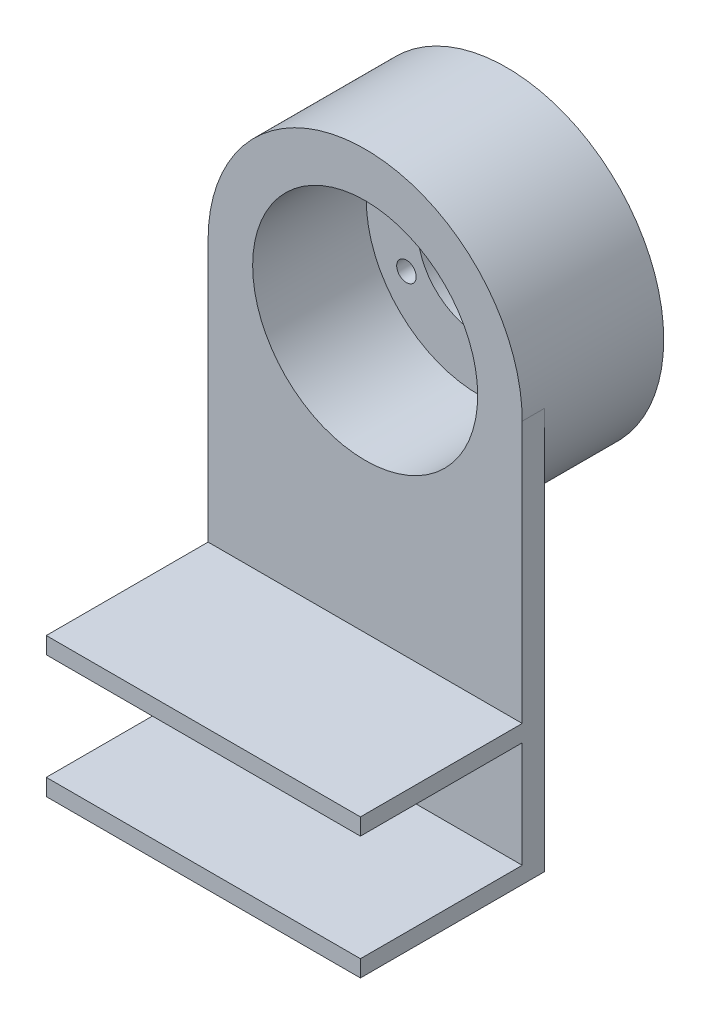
ISO-10303-21;
HEADER;
FILE_DESCRIPTION(('STEP AP214'),'2;1');
FILE_NAME('part.step','',(''),(''),'','','');
FILE_SCHEMA(('AUTOMOTIVE_DESIGN { 1 0 10303 214 1 1 1 1 }'));
ENDSEC;
DATA;
#1=APPLICATION_CONTEXT('core data for automotive mechanical design processes');
#2=APPLICATION_PROTOCOL_DEFINITION('international standard','automotive_design',2000,#1);
#3=PRODUCT_CONTEXT('',#1,'mechanical');
#4=PRODUCT('Part','Part','',(#3));
#5=PRODUCT_RELATED_PRODUCT_CATEGORY('part','',(#4));
#6=PRODUCT_DEFINITION_FORMATION('','',#4);
#7=PRODUCT_DEFINITION_CONTEXT('part definition',#1,'design');
#8=PRODUCT_DEFINITION('design','',#6,#7);
#9=PRODUCT_DEFINITION_SHAPE('','',#8);
#10=(LENGTH_UNIT() NAMED_UNIT(*) SI_UNIT(.MILLI.,.METRE.));
#11=(NAMED_UNIT(*) PLANE_ANGLE_UNIT() SI_UNIT($,.RADIAN.));
#12=(NAMED_UNIT(*) SI_UNIT($,.STERADIAN.) SOLID_ANGLE_UNIT());
#13=UNCERTAINTY_MEASURE_WITH_UNIT(LENGTH_MEASURE(1.E-05),#10,'distance_accuracy_value','');
#14=(GEOMETRIC_REPRESENTATION_CONTEXT(3) GLOBAL_UNCERTAINTY_ASSIGNED_CONTEXT((#13)) GLOBAL_UNIT_ASSIGNED_CONTEXT((#10,
#11,#12)) REPRESENTATION_CONTEXT('',''));
#15=CARTESIAN_POINT('',(0.,0.,0.));
#16=DIRECTION('',(0.,0.,1.));
#17=DIRECTION('',(1.,0.,0.));
#18=AXIS2_PLACEMENT_3D('',#15,#16,#17);
#19=CARTESIAN_POINT('',(0.,50.,4.));
#20=DIRECTION('',(0.,0.,1.));
#21=DIRECTION('',(1.,0.,0.));
#22=AXIS2_PLACEMENT_3D('',#19,#20,#21);
#23=PLANE('',#22);
#24=CARTESIAN_POINT('',(0.,50.,4.));
#25=DIRECTION('',(0.,0.,1.));
#26=DIRECTION('',(1.,0.,0.));
#27=AXIS2_PLACEMENT_3D('',#24,#25,#26);
#28=CIRCLE('',#27,20.2);
#29=CARTESIAN_POINT('',(20.2,50.,4.));
#30=VERTEX_POINT('',#29);
#31=EDGE_CURVE('E213',#30,#30,#28,.T.);
#32=ORIENTED_EDGE('',*,*,#31,.F.);
#33=EDGE_LOOP('',(#32));
#34=FACE_BOUND('',#33,.T.);
#35=DIRECTION('',(0.,-1.,0.));
#36=VECTOR('',#35,1.);
#37=CARTESIAN_POINT('',(-28.2,0.,4.));
#38=LINE('',#37,#36);
#39=CARTESIAN_POINT('',(-28.2,50.,4.));
#40=VERTEX_POINT('',#39);
#41=CARTESIAN_POINT('',(-28.2,2.99999999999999,4.));
#42=VERTEX_POINT('',#41);
#43=EDGE_CURVE('E224',#40,#42,#38,.T.);
#44=ORIENTED_EDGE('',*,*,#43,.T.);
#45=DIRECTION('',(1.,0.,0.));
#46=VECTOR('',#45,1.);
#47=CARTESIAN_POINT('',(0.,3.,4.));
#48=LINE('',#47,#46);
#49=CARTESIAN_POINT('',(28.2,3.00000000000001,4.));
#50=VERTEX_POINT('',#49);
#51=EDGE_CURVE('E12',#42,#50,#48,.T.);
#52=ORIENTED_EDGE('',*,*,#51,.T.);
#53=DIRECTION('',(0.,1.,0.));
#54=VECTOR('',#53,1.);
#55=CARTESIAN_POINT('',(28.2,50.,4.));
#56=LINE('',#55,#54);
#57=CARTESIAN_POINT('',(28.2,50.,4.));
#58=VERTEX_POINT('',#57);
#59=EDGE_CURVE('E63',#50,#58,#56,.T.);
#60=ORIENTED_EDGE('',*,*,#59,.T.);
#61=CARTESIAN_POINT('',(0.,50.,4.));
#62=DIRECTION('',(0.,0.,1.));
#63=DIRECTION('',(1.,0.,0.));
#64=AXIS2_PLACEMENT_3D('',#61,#62,#63);
#65=CIRCLE('',#64,28.2);
#66=EDGE_CURVE('E221',#58,#40,#65,.T.);
#67=ORIENTED_EDGE('',*,*,#66,.T.);
#68=EDGE_LOOP('',(#44,#52,#60,#67));
#69=FACE_BOUND('',#68,.T.);
#70=ADVANCED_FACE('F43',(#34,#69),#23,.T.);
#71=CARTESIAN_POINT('',(0.,50.,0.));
#72=DIRECTION('',(0.,0.,1.));
#73=DIRECTION('',(1.,0.,0.));
#74=AXIS2_PLACEMENT_3D('',#71,#72,#73);
#75=PLANE('',#74);
#76=CARTESIAN_POINT('',(0.,50.,0.));
#77=DIRECTION('',(0.,0.,-1.));
#78=DIRECTION('',(-1.,0.,0.));
#79=AXIS2_PLACEMENT_3D('',#76,#77,#78);
#80=CIRCLE('',#79,28.2);
#81=CARTESIAN_POINT('',(28.2,50.,0.));
#82=VERTEX_POINT('',#81);
#83=CARTESIAN_POINT('',(-28.2,50.,0.));
#84=VERTEX_POINT('',#83);
#85=EDGE_CURVE('E51',#82,#84,#80,.T.);
#86=ORIENTED_EDGE('',*,*,#85,.F.);
#87=DIRECTION('',(0.,1.,0.));
#88=VECTOR('',#87,1.);
#89=CARTESIAN_POINT('',(28.2,50.,0.));
#90=LINE('',#89,#88);
#91=CARTESIAN_POINT('',(28.2,-22.05,0.));
#92=VERTEX_POINT('',#91);
#93=EDGE_CURVE('E77',#92,#82,#90,.T.);
#94=ORIENTED_EDGE('',*,*,#93,.F.);
#95=DIRECTION('',(-1.,0.,0.));
#96=VECTOR('',#95,1.);
#97=CARTESIAN_POINT('',(69.670531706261,-22.05,0.));
#98=LINE('',#97,#96);
#99=CARTESIAN_POINT('',(-28.2,-22.05,0.));
#100=VERTEX_POINT('',#99);
#101=EDGE_CURVE('E177',#92,#100,#98,.T.);
#102=ORIENTED_EDGE('',*,*,#101,.T.);
#103=DIRECTION('',(0.,-1.,0.));
#104=VECTOR('',#103,1.);
#105=CARTESIAN_POINT('',(-28.2,0.,0.));
#106=LINE('',#105,#104);
#107=EDGE_CURVE('E219',#84,#100,#106,.T.);
#108=ORIENTED_EDGE('',*,*,#107,.F.);
#109=EDGE_LOOP('',(#86,#94,#102,#108));
#110=FACE_BOUND('',#109,.T.);
#111=ADVANCED_FACE('F257',(#110),#75,.F.);
#112=CARTESIAN_POINT('',(0.,50.,4.));
#113=DIRECTION('',(0.,0.,-1.));
#114=DIRECTION('',(-1.,0.,0.));
#115=AXIS2_PLACEMENT_3D('',#112,#113,#114);
#116=CYLINDRICAL_SURFACE('',#115,28.2);
#117=DIRECTION('',(0.,0.,-1.));
#118=VECTOR('',#117,1.);
#119=CARTESIAN_POINT('',(28.2,50.,4.));
#120=LINE('',#119,#118);
#121=EDGE_CURVE('E227',#58,#82,#120,.T.);
#122=ORIENTED_EDGE('',*,*,#121,.T.);
#123=ORIENTED_EDGE('',*,*,#85,.T.);
#124=DIRECTION('',(0.,0.,-1.));
#125=VECTOR('',#124,1.);
#126=CARTESIAN_POINT('',(-28.2,50.,4.));
#127=LINE('',#126,#125);
#128=EDGE_CURVE('E84',#40,#84,#127,.T.);
#129=ORIENTED_EDGE('',*,*,#128,.F.);
#130=ORIENTED_EDGE('',*,*,#66,.F.);
#131=EDGE_LOOP('',(#122,#123,#129,#130));
#132=FACE_BOUND('',#131,.T.);
#133=CARTESIAN_POINT('',(0.,50.,-21.4));
#134=DIRECTION('',(0.,0.,-1.));
#135=DIRECTION('',(-1.,0.,0.));
#136=AXIS2_PLACEMENT_3D('',#133,#134,#135);
#137=CIRCLE('',#136,28.2);
#138=CARTESIAN_POINT('',(-28.2,50.,-21.4));
#139=VERTEX_POINT('',#138);
#140=EDGE_CURVE('E215',#139,#139,#137,.T.);
#141=ORIENTED_EDGE('',*,*,#140,.F.);
#142=EDGE_LOOP('',(#141));
#143=FACE_BOUND('',#142,.T.);
#144=ADVANCED_FACE('F44',(#132,#143),#116,.T.);
#145=CARTESIAN_POINT('',(-28.2,0.,4.));
#146=DIRECTION('',(1.,0.,0.));
#147=DIRECTION('',(0.,0.,-1.));
#148=AXIS2_PLACEMENT_3D('',#145,#146,#147);
#149=PLANE('',#148);
#150=ORIENTED_EDGE('',*,*,#107,.T.);
#151=DIRECTION('',(0.,0.,1.));
#152=VECTOR('',#151,1.);
#153=CARTESIAN_POINT('',(-28.2,-22.05,0.));
#154=LINE('',#153,#152);
#155=CARTESIAN_POINT('',(-28.2,-22.05,33.05));
#156=VERTEX_POINT('',#155);
#157=EDGE_CURVE('E149',#100,#156,#154,.T.);
#158=ORIENTED_EDGE('',*,*,#157,.T.);
#159=DIRECTION('',(0.,1.,0.));
#160=VECTOR('',#159,1.);
#161=CARTESIAN_POINT('',(-28.2,-19.05,33.05));
#162=LINE('',#161,#160);
#163=CARTESIAN_POINT('',(-28.2,-19.05,33.05));
#164=VERTEX_POINT('',#163);
#165=EDGE_CURVE('E133',#156,#164,#162,.T.);
#166=ORIENTED_EDGE('',*,*,#165,.T.);
#167=DIRECTION('',(0.,0.,-1.));
#168=VECTOR('',#167,1.);
#169=CARTESIAN_POINT('',(-28.2,-19.05,33.05));
#170=LINE('',#169,#168);
#171=CARTESIAN_POINT('',(-28.2,-19.05,4.));
#172=VERTEX_POINT('',#171);
#173=EDGE_CURVE('E143',#164,#172,#170,.T.);
#174=ORIENTED_EDGE('',*,*,#173,.T.);
#175=DIRECTION('',(0.,1.,0.));
#176=VECTOR('',#175,1.);
#177=CARTESIAN_POINT('',(-28.2,-19.05,4.));
#178=LINE('',#177,#176);
#179=CARTESIAN_POINT('',(-28.2,0.,4.));
#180=VERTEX_POINT('',#179);
#181=EDGE_CURVE('E153',#172,#180,#178,.T.);
#182=ORIENTED_EDGE('',*,*,#181,.T.);
#183=DIRECTION('',(0.,0.,1.));
#184=VECTOR('',#183,1.);
#185=CARTESIAN_POINT('',(-28.2,0.,4.));
#186=LINE('',#185,#184);
#187=CARTESIAN_POINT('',(-28.2,0.,33.05));
#188=VERTEX_POINT('',#187);
#189=EDGE_CURVE('E157',#180,#188,#186,.T.);
#190=ORIENTED_EDGE('',*,*,#189,.T.);
#191=DIRECTION('',(0.,1.,0.));
#192=VECTOR('',#191,1.);
#193=CARTESIAN_POINT('',(-28.2,2.99999999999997,33.05));
#194=LINE('',#193,#192);
#195=CARTESIAN_POINT('',(-28.2,2.99999999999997,33.05));
#196=VERTEX_POINT('',#195);
#197=EDGE_CURVE('E242',#188,#196,#194,.T.);
#198=ORIENTED_EDGE('',*,*,#197,.T.);
#199=DIRECTION('',(0.,0.,-1.));
#200=VECTOR('',#199,1.);
#201=CARTESIAN_POINT('',(-28.2,2.99999999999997,33.05));
#202=LINE('',#201,#200);
#203=EDGE_CURVE('E237',#196,#42,#202,.T.);
#204=ORIENTED_EDGE('',*,*,#203,.T.);
#205=ORIENTED_EDGE('',*,*,#43,.F.);
#206=ORIENTED_EDGE('',*,*,#128,.T.);
#207=EDGE_LOOP('',(#150,#158,#166,#174,#182,#190,#198,#204,#205,#206));
#208=FACE_BOUND('',#207,.T.);
#209=ADVANCED_FACE('F141',(#208),#149,.F.);
#210=CARTESIAN_POINT('',(28.2,50.,4.));
#211=DIRECTION('',(-1.,0.,0.));
#212=DIRECTION('',(0.,-1.,0.));
#213=AXIS2_PLACEMENT_3D('',#210,#211,#212);
#214=PLANE('',#213);
#215=ORIENTED_EDGE('',*,*,#59,.F.);
#216=DIRECTION('',(0.,0.,-1.));
#217=VECTOR('',#216,1.);
#218=CARTESIAN_POINT('',(28.2,2.99999999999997,33.05));
#219=LINE('',#218,#217);
#220=CARTESIAN_POINT('',(28.2,2.99999999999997,33.05));
#221=VERTEX_POINT('',#220);
#222=EDGE_CURVE('E59',#221,#50,#219,.T.);
#223=ORIENTED_EDGE('',*,*,#222,.F.);
#224=DIRECTION('',(0.,1.,0.));
#225=VECTOR('',#224,1.);
#226=CARTESIAN_POINT('',(28.2,2.99999999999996,33.05));
#227=LINE('',#226,#225);
#228=CARTESIAN_POINT('',(28.2,0.,33.05));
#229=VERTEX_POINT('',#228);
#230=EDGE_CURVE('E163',#229,#221,#227,.T.);
#231=ORIENTED_EDGE('',*,*,#230,.F.);
#232=DIRECTION('',(0.,0.,1.));
#233=VECTOR('',#232,1.);
#234=CARTESIAN_POINT('',(28.2,0.,4.));
#235=LINE('',#234,#233);
#236=CARTESIAN_POINT('',(28.2,0.,4.));
#237=VERTEX_POINT('',#236);
#238=EDGE_CURVE('E165',#237,#229,#235,.T.);
#239=ORIENTED_EDGE('',*,*,#238,.F.);
#240=DIRECTION('',(0.,1.,0.));
#241=VECTOR('',#240,1.);
#242=CARTESIAN_POINT('',(28.2,-19.05,4.));
#243=LINE('',#242,#241);
#244=CARTESIAN_POINT('',(28.2,-19.05,4.));
#245=VERTEX_POINT('',#244);
#246=EDGE_CURVE('E175',#245,#237,#243,.T.);
#247=ORIENTED_EDGE('',*,*,#246,.F.);
#248=DIRECTION('',(0.,0.,-1.));
#249=VECTOR('',#248,1.);
#250=CARTESIAN_POINT('',(28.2,-19.05,33.05));
#251=LINE('',#250,#249);
#252=CARTESIAN_POINT('',(28.2,-19.05,33.05));
#253=VERTEX_POINT('',#252);
#254=EDGE_CURVE('E167',#253,#245,#251,.T.);
#255=ORIENTED_EDGE('',*,*,#254,.F.);
#256=DIRECTION('',(0.,1.,0.));
#257=VECTOR('',#256,1.);
#258=CARTESIAN_POINT('',(28.2,-19.05,33.05));
#259=LINE('',#258,#257);
#260=CARTESIAN_POINT('',(28.2,-22.05,33.05));
#261=VERTEX_POINT('',#260);
#262=EDGE_CURVE('E132',#261,#253,#259,.T.);
#263=ORIENTED_EDGE('',*,*,#262,.F.);
#264=DIRECTION('',(0.,0.,1.));
#265=VECTOR('',#264,1.);
#266=CARTESIAN_POINT('',(28.2,-22.05,0.));
#267=LINE('',#266,#265);
#268=EDGE_CURVE('E168',#92,#261,#267,.T.);
#269=ORIENTED_EDGE('',*,*,#268,.F.);
#270=ORIENTED_EDGE('',*,*,#93,.T.);
#271=ORIENTED_EDGE('',*,*,#121,.F.);
#272=EDGE_LOOP('',(#215,#223,#231,#239,#247,#255,#263,#269,#270,#271));
#273=FACE_BOUND('',#272,.T.);
#274=ADVANCED_FACE('F234',(#273),#214,.F.);
#275=CARTESIAN_POINT('',(0.,50.,4.));
#276=DIRECTION('',(0.,0.,-1.));
#277=DIRECTION('',(-1.,0.,0.));
#278=AXIS2_PLACEMENT_3D('',#275,#276,#277);
#279=CYLINDRICAL_SURFACE('',#278,20.2);
#280=ORIENTED_EDGE('',*,*,#31,.T.);
#281=EDGE_LOOP('',(#280));
#282=FACE_BOUND('',#281,.T.);
#283=CARTESIAN_POINT('',(0.,50.,-16.4));
#284=DIRECTION('',(0.,0.,-1.));
#285=DIRECTION('',(-1.,0.,0.));
#286=AXIS2_PLACEMENT_3D('',#283,#284,#285);
#287=CIRCLE('',#286,20.2);
#288=CARTESIAN_POINT('',(-20.2,50.,-16.4));
#289=VERTEX_POINT('',#288);
#290=EDGE_CURVE('E172',#289,#289,#287,.F.);
#291=ORIENTED_EDGE('',*,*,#290,.F.);
#292=EDGE_LOOP('',(#291));
#293=FACE_BOUND('',#292,.T.);
#294=ADVANCED_FACE('F268',(#282,#293),#279,.F.);
#295=CARTESIAN_POINT('',(0.,50.,-21.4));
#296=DIRECTION('',(0.,0.,-1.));
#297=DIRECTION('',(-1.,0.,0.));
#298=AXIS2_PLACEMENT_3D('',#295,#296,#297);
#299=PLANE('',#298);
#300=CARTESIAN_POINT('',(-12.9903810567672,42.5000000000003,-21.4));
#301=DIRECTION('',(0.,0.,-1.));
#302=DIRECTION('',(-1.,0.,0.));
#303=AXIS2_PLACEMENT_3D('',#300,#301,#302);
#304=CIRCLE('',#303,1.75000000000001);
#305=CARTESIAN_POINT('',(-14.7403810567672,42.5000000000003,-21.4));
#306=VERTEX_POINT('',#305);
#307=EDGE_CURVE('E204',#306,#306,#304,.T.);
#308=ORIENTED_EDGE('',*,*,#307,.F.);
#309=EDGE_LOOP('',(#308));
#310=FACE_BOUND('',#309,.T.);
#311=CARTESIAN_POINT('',(0.,50.,-21.4));
#312=DIRECTION('',(0.,0.,-1.));
#313=DIRECTION('',(-1.,0.,0.));
#314=AXIS2_PLACEMENT_3D('',#311,#312,#313);
#315=CIRCLE('',#314,11.);
#316=CARTESIAN_POINT('',(-11.,50.,-21.4));
#317=VERTEX_POINT('',#316);
#318=EDGE_CURVE('E209',#317,#317,#315,.T.);
#319=ORIENTED_EDGE('',*,*,#318,.F.);
#320=EDGE_LOOP('',(#319));
#321=FACE_BOUND('',#320,.T.);
#322=ORIENTED_EDGE('',*,*,#140,.T.);
#323=EDGE_LOOP('',(#322));
#324=FACE_BOUND('',#323,.T.);
#325=CARTESIAN_POINT('',(0.,65.,-21.4));
#326=DIRECTION('',(0.,0.,-1.));
#327=DIRECTION('',(-1.,0.,0.));
#328=AXIS2_PLACEMENT_3D('',#325,#326,#327);
#329=CIRCLE('',#328,1.75);
#330=CARTESIAN_POINT('',(-1.75,65.,-21.4));
#331=VERTEX_POINT('',#330);
#332=EDGE_CURVE('E207',#331,#331,#329,.T.);
#333=ORIENTED_EDGE('',*,*,#332,.F.);
#334=EDGE_LOOP('',(#333));
#335=FACE_BOUND('',#334,.T.);
#336=CARTESIAN_POINT('',(12.990381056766,42.4999999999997,-21.4));
#337=DIRECTION('',(0.,0.,-1.));
#338=DIRECTION('',(-1.,0.,0.));
#339=AXIS2_PLACEMENT_3D('',#336,#337,#338);
#340=CIRCLE('',#339,1.75000000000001);
#341=CARTESIAN_POINT('',(11.240381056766,42.4999999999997,-21.4));
#342=VERTEX_POINT('',#341);
#343=EDGE_CURVE('E198',#342,#342,#340,.T.);
#344=ORIENTED_EDGE('',*,*,#343,.F.);
#345=EDGE_LOOP('',(#344));
#346=FACE_BOUND('',#345,.T.);
#347=ADVANCED_FACE('F383',(#310,#321,#324,#335,#346),#299,.T.);
#348=CARTESIAN_POINT('',(0.,50.,-21.4));
#349=DIRECTION('',(0.,0.,1.));
#350=DIRECTION('',(1.,0.,0.));
#351=AXIS2_PLACEMENT_3D('',#348,#349,#350);
#352=CYLINDRICAL_SURFACE('',#351,11.);
#353=CARTESIAN_POINT('',(0.,50.,-16.4));
#354=DIRECTION('',(0.,0.,-1.));
#355=DIRECTION('',(-1.,0.,0.));
#356=AXIS2_PLACEMENT_3D('',#353,#354,#355);
#357=CIRCLE('',#356,11.);
#358=CARTESIAN_POINT('',(-11.,50.,-16.4));
#359=VERTEX_POINT('',#358);
#360=EDGE_CURVE('E193',#359,#359,#357,.T.);
#361=ORIENTED_EDGE('',*,*,#360,.F.);
#362=EDGE_LOOP('',(#361));
#363=FACE_BOUND('',#362,.T.);
#364=ORIENTED_EDGE('',*,*,#318,.T.);
#365=EDGE_LOOP('',(#364));
#366=FACE_BOUND('',#365,.T.);
#367=ADVANCED_FACE('F376',(#363,#366),#352,.F.);
#368=CARTESIAN_POINT('',(0.,65.,-21.4));
#369=DIRECTION('',(0.,0.,1.));
#370=DIRECTION('',(1.,0.,0.));
#371=AXIS2_PLACEMENT_3D('',#368,#369,#370);
#372=CYLINDRICAL_SURFACE('',#371,1.75);
#373=CARTESIAN_POINT('',(0.,65.,-16.4));
#374=DIRECTION('',(0.,0.,-1.));
#375=DIRECTION('',(-1.,0.,0.));
#376=AXIS2_PLACEMENT_3D('',#373,#374,#375);
#377=CIRCLE('',#376,1.75);
#378=CARTESIAN_POINT('',(-1.75,65.,-16.4));
#379=VERTEX_POINT('',#378);
#380=EDGE_CURVE('E195',#379,#379,#377,.T.);
#381=ORIENTED_EDGE('',*,*,#380,.F.);
#382=EDGE_LOOP('',(#381));
#383=FACE_BOUND('',#382,.T.);
#384=ORIENTED_EDGE('',*,*,#332,.T.);
#385=EDGE_LOOP('',(#384));
#386=FACE_BOUND('',#385,.T.);
#387=ADVANCED_FACE('F370',(#383,#386),#372,.F.);
#388=CARTESIAN_POINT('',(-12.9903810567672,42.5000000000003,-21.4));
#389=DIRECTION('',(0.,0.,1.));
#390=DIRECTION('',(1.,0.,0.));
#391=AXIS2_PLACEMENT_3D('',#388,#389,#390);
#392=CYLINDRICAL_SURFACE('',#391,1.75000000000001);
#393=CARTESIAN_POINT('',(-12.9903810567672,42.5000000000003,-16.4));
#394=DIRECTION('',(0.,0.,-1.));
#395=DIRECTION('',(-1.,0.,0.));
#396=AXIS2_PLACEMENT_3D('',#393,#394,#395);
#397=CIRCLE('',#396,1.75000000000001);
#398=CARTESIAN_POINT('',(-14.7403810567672,42.5000000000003,-16.4));
#399=VERTEX_POINT('',#398);
#400=EDGE_CURVE('E186',#399,#399,#397,.T.);
#401=ORIENTED_EDGE('',*,*,#400,.F.);
#402=EDGE_LOOP('',(#401));
#403=FACE_BOUND('',#402,.T.);
#404=ORIENTED_EDGE('',*,*,#307,.T.);
#405=EDGE_LOOP('',(#404));
#406=FACE_BOUND('',#405,.T.);
#407=ADVANCED_FACE('F356',(#403,#406),#392,.F.);
#408=CARTESIAN_POINT('',(12.990381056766,42.4999999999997,-21.4));
#409=DIRECTION('',(0.,0.,1.));
#410=DIRECTION('',(1.,0.,0.));
#411=AXIS2_PLACEMENT_3D('',#408,#409,#410);
#412=CYLINDRICAL_SURFACE('',#411,1.75000000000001);
#413=CARTESIAN_POINT('',(12.990381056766,42.4999999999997,-16.4));
#414=DIRECTION('',(0.,0.,-1.));
#415=DIRECTION('',(-1.,0.,0.));
#416=AXIS2_PLACEMENT_3D('',#413,#414,#415);
#417=CIRCLE('',#416,1.75000000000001);
#418=CARTESIAN_POINT('',(11.240381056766,42.4999999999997,-16.4));
#419=VERTEX_POINT('',#418);
#420=EDGE_CURVE('E187',#419,#419,#417,.T.);
#421=ORIENTED_EDGE('',*,*,#420,.F.);
#422=EDGE_LOOP('',(#421));
#423=FACE_BOUND('',#422,.T.);
#424=ORIENTED_EDGE('',*,*,#343,.T.);
#425=EDGE_LOOP('',(#424));
#426=FACE_BOUND('',#425,.T.);
#427=ADVANCED_FACE('F348',(#423,#426),#412,.F.);
#428=CARTESIAN_POINT('',(0.,50.,-16.4));
#429=DIRECTION('',(0.,0.,-1.));
#430=DIRECTION('',(-1.,0.,0.));
#431=AXIS2_PLACEMENT_3D('',#428,#429,#430);
#432=PLANE('',#431);
#433=ORIENTED_EDGE('',*,*,#360,.T.);
#434=EDGE_LOOP('',(#433));
#435=FACE_BOUND('',#434,.T.);
#436=ORIENTED_EDGE('',*,*,#380,.T.);
#437=EDGE_LOOP('',(#436));
#438=FACE_BOUND('',#437,.T.);
#439=ORIENTED_EDGE('',*,*,#400,.T.);
#440=EDGE_LOOP('',(#439));
#441=FACE_BOUND('',#440,.T.);
#442=ORIENTED_EDGE('',*,*,#420,.T.);
#443=EDGE_LOOP('',(#442));
#444=FACE_BOUND('',#443,.T.);
#445=ORIENTED_EDGE('',*,*,#290,.T.);
#446=EDGE_LOOP('',(#445));
#447=FACE_BOUND('',#446,.T.);
#448=ADVANCED_FACE('F282',(#435,#438,#441,#444,#447),#432,.F.);
#449=CARTESIAN_POINT('',(69.670531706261,0.,4.));
#450=DIRECTION('',(0.,1.,0.));
#451=DIRECTION('',(0.,0.,1.));
#452=AXIS2_PLACEMENT_3D('',#449,#450,#451);
#453=PLANE('',#452);
#454=DIRECTION('',(-1.,0.,0.));
#455=VECTOR('',#454,1.);
#456=CARTESIAN_POINT('',(69.670531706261,0.,4.));
#457=LINE('',#456,#455);
#458=EDGE_CURVE('E155',#237,#180,#457,.T.);
#459=ORIENTED_EDGE('',*,*,#458,.F.);
#460=ORIENTED_EDGE('',*,*,#238,.T.);
#461=DIRECTION('',(-1.,0.,0.));
#462=VECTOR('',#461,1.);
#463=CARTESIAN_POINT('',(69.670531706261,0.,33.05));
#464=LINE('',#463,#462);
#465=EDGE_CURVE('E154',#229,#188,#464,.T.);
#466=ORIENTED_EDGE('',*,*,#465,.T.);
#467=ORIENTED_EDGE('',*,*,#189,.F.);
#468=EDGE_LOOP('',(#459,#460,#466,#467));
#469=FACE_BOUND('',#468,.T.);
#470=ADVANCED_FACE('F248',(#469),#453,.F.);
#471=CARTESIAN_POINT('',(69.670531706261,2.99999999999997,33.05));
#472=DIRECTION('',(0.,0.,-1.));
#473=DIRECTION('',(-1.,0.,0.));
#474=AXIS2_PLACEMENT_3D('',#471,#472,#473);
#475=PLANE('',#474);
#476=ORIENTED_EDGE('',*,*,#465,.F.);
#477=ORIENTED_EDGE('',*,*,#230,.T.);
#478=DIRECTION('',(-1.,0.,0.));
#479=VECTOR('',#478,1.);
#480=CARTESIAN_POINT('',(69.670531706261,2.99999999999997,33.05));
#481=LINE('',#480,#479);
#482=EDGE_CURVE('E180',#221,#196,#481,.T.);
#483=ORIENTED_EDGE('',*,*,#482,.T.);
#484=ORIENTED_EDGE('',*,*,#197,.F.);
#485=EDGE_LOOP('',(#476,#477,#483,#484));
#486=FACE_BOUND('',#485,.T.);
#487=ADVANCED_FACE('F243',(#486),#475,.F.);
#488=CARTESIAN_POINT('',(69.670531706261,2.99999999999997,33.05));
#489=DIRECTION('',(0.,-1.,0.));
#490=DIRECTION('',(0.,0.,-1.));
#491=AXIS2_PLACEMENT_3D('',#488,#489,#490);
#492=PLANE('',#491);
#493=ORIENTED_EDGE('',*,*,#51,.F.);
#494=ORIENTED_EDGE('',*,*,#203,.F.);
#495=ORIENTED_EDGE('',*,*,#482,.F.);
#496=ORIENTED_EDGE('',*,*,#222,.T.);
#497=EDGE_LOOP('',(#493,#494,#495,#496));
#498=FACE_BOUND('',#497,.T.);
#499=ADVANCED_FACE('F240',(#498),#492,.F.);
#500=CARTESIAN_POINT('',(69.670531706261,-22.05,0.));
#501=DIRECTION('',(0.,1.,0.));
#502=DIRECTION('',(0.,0.,1.));
#503=AXIS2_PLACEMENT_3D('',#500,#501,#502);
#504=PLANE('',#503);
#505=ORIENTED_EDGE('',*,*,#101,.F.);
#506=ORIENTED_EDGE('',*,*,#268,.T.);
#507=DIRECTION('',(-1.,0.,0.));
#508=VECTOR('',#507,1.);
#509=CARTESIAN_POINT('',(69.670531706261,-22.05,33.05));
#510=LINE('',#509,#508);
#511=EDGE_CURVE('E138',#261,#156,#510,.T.);
#512=ORIENTED_EDGE('',*,*,#511,.T.);
#513=ORIENTED_EDGE('',*,*,#157,.F.);
#514=EDGE_LOOP('',(#505,#506,#512,#513));
#515=FACE_BOUND('',#514,.T.);
#516=ADVANCED_FACE('F251',(#515),#504,.F.);
#517=CARTESIAN_POINT('',(69.670531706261,-19.05,33.05));
#518=DIRECTION('',(0.,0.,-1.));
#519=DIRECTION('',(-1.,0.,0.));
#520=AXIS2_PLACEMENT_3D('',#517,#518,#519);
#521=PLANE('',#520);
#522=ORIENTED_EDGE('',*,*,#511,.F.);
#523=ORIENTED_EDGE('',*,*,#262,.T.);
#524=DIRECTION('',(-1.,0.,0.));
#525=VECTOR('',#524,1.);
#526=CARTESIAN_POINT('',(69.670531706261,-19.05,33.05));
#527=LINE('',#526,#525);
#528=EDGE_CURVE('E126',#253,#164,#527,.T.);
#529=ORIENTED_EDGE('',*,*,#528,.T.);
#530=ORIENTED_EDGE('',*,*,#165,.F.);
#531=EDGE_LOOP('',(#522,#523,#529,#530));
#532=FACE_BOUND('',#531,.T.);
#533=ADVANCED_FACE('F135',(#532),#521,.F.);
#534=CARTESIAN_POINT('',(69.670531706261,-19.05,33.05));
#535=DIRECTION('',(0.,-1.,0.));
#536=DIRECTION('',(0.,0.,-1.));
#537=AXIS2_PLACEMENT_3D('',#534,#535,#536);
#538=PLANE('',#537);
#539=ORIENTED_EDGE('',*,*,#528,.F.);
#540=ORIENTED_EDGE('',*,*,#254,.T.);
#541=DIRECTION('',(-1.,0.,0.));
#542=VECTOR('',#541,1.);
#543=CARTESIAN_POINT('',(69.670531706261,-19.05,4.));
#544=LINE('',#543,#542);
#545=EDGE_CURVE('E139',#245,#172,#544,.T.);
#546=ORIENTED_EDGE('',*,*,#545,.T.);
#547=ORIENTED_EDGE('',*,*,#173,.F.);
#548=EDGE_LOOP('',(#539,#540,#546,#547));
#549=FACE_BOUND('',#548,.T.);
#550=ADVANCED_FACE('F148',(#549),#538,.F.);
#551=CARTESIAN_POINT('',(69.670531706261,-19.05,4.));
#552=DIRECTION('',(0.,0.,-1.));
#553=DIRECTION('',(-1.,0.,0.));
#554=AXIS2_PLACEMENT_3D('',#551,#552,#553);
#555=PLANE('',#554);
#556=ORIENTED_EDGE('',*,*,#545,.F.);
#557=ORIENTED_EDGE('',*,*,#246,.T.);
#558=ORIENTED_EDGE('',*,*,#458,.T.);
#559=ORIENTED_EDGE('',*,*,#181,.F.);
#560=EDGE_LOOP('',(#556,#557,#558,#559));
#561=FACE_BOUND('',#560,.T.);
#562=ADVANCED_FACE('F252',(#561),#555,.F.);
#563=CLOSED_SHELL('',(#70,#111,#144,#209,#274,#294,#347,#367,#387,#407,#427,#448,#470,#487,#499,
#516,#533,#550,#562));
#564=MANIFOLD_SOLID_BREP('B2',#563);
#565=ADVANCED_BREP_SHAPE_REPRESENTATION('',(#18,#564),#14);
#566=SHAPE_DEFINITION_REPRESENTATION(#9,#565);
ENDSEC;
END-ISO-10303-21;
